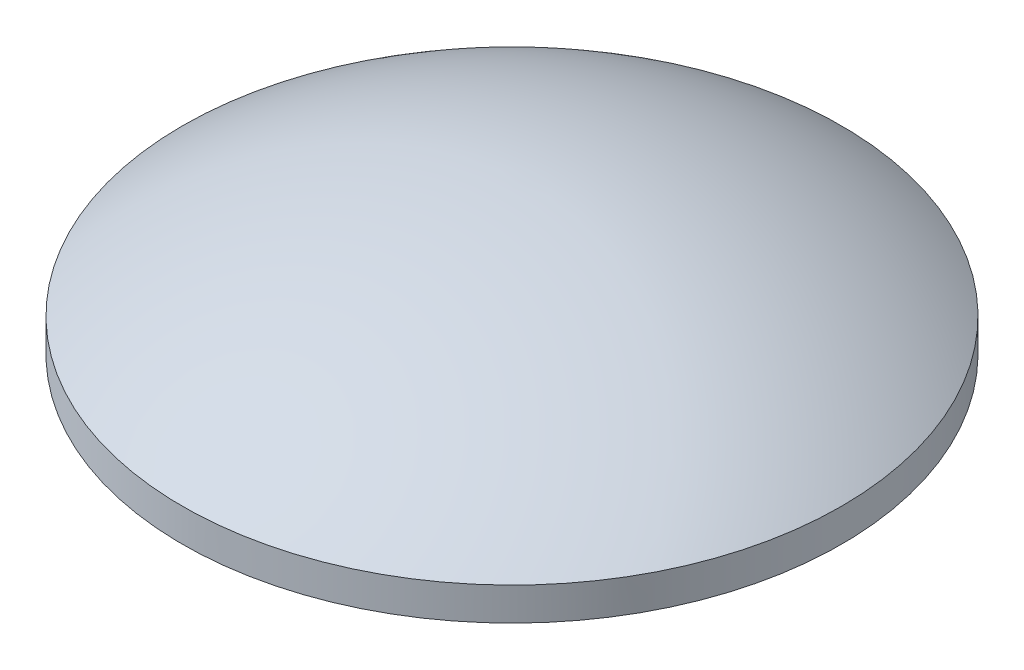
ISO-10303-21;
HEADER;
FILE_DESCRIPTION(('STEP AP214'),'2;1');
FILE_NAME('part.step','',(''),(''),'','','');
FILE_SCHEMA(('AUTOMOTIVE_DESIGN { 1 0 10303 214 1 1 1 1 }'));
ENDSEC;
DATA;
#1=APPLICATION_CONTEXT('core data for automotive mechanical design processes');
#2=APPLICATION_PROTOCOL_DEFINITION('international standard','automotive_design',2000,#1);
#3=PRODUCT_CONTEXT('',#1,'mechanical');
#4=PRODUCT('Part','Part','',(#3));
#5=PRODUCT_RELATED_PRODUCT_CATEGORY('part','',(#4));
#6=PRODUCT_DEFINITION_FORMATION('','',#4);
#7=PRODUCT_DEFINITION_CONTEXT('part definition',#1,'design');
#8=PRODUCT_DEFINITION('design','',#6,#7);
#9=PRODUCT_DEFINITION_SHAPE('','',#8);
#10=(LENGTH_UNIT() NAMED_UNIT(*) SI_UNIT(.MILLI.,.METRE.));
#11=(NAMED_UNIT(*) PLANE_ANGLE_UNIT() SI_UNIT($,.RADIAN.));
#12=(NAMED_UNIT(*) SI_UNIT($,.STERADIAN.) SOLID_ANGLE_UNIT());
#13=UNCERTAINTY_MEASURE_WITH_UNIT(LENGTH_MEASURE(1.E-05),#10,'distance_accuracy_value','');
#14=(GEOMETRIC_REPRESENTATION_CONTEXT(3) GLOBAL_UNCERTAINTY_ASSIGNED_CONTEXT((#13)) GLOBAL_UNIT_ASSIGNED_CONTEXT((#10,
#11,#12)) REPRESENTATION_CONTEXT('',''));
#15=CARTESIAN_POINT('',(0.,0.,0.));
#16=DIRECTION('',(0.,0.,1.));
#17=DIRECTION('',(1.,0.,0.));
#18=AXIS2_PLACEMENT_3D('',#15,#16,#17);
#19=CARTESIAN_POINT('',(-12.,-24.,0.));
#20=DIRECTION('',(0.,1.,0.));
#21=DIRECTION('',(-1.,0.,0.));
#22=AXIS2_PLACEMENT_3D('',#19,#20,#21);
#23=SPHERICAL_SURFACE('',#22,30.);
#24=CARTESIAN_POINT('',(-12.,0.199999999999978,0.));
#25=DIRECTION('',(0.,1.,0.));
#26=DIRECTION('',(-1.,0.,0.));
#27=AXIS2_PLACEMENT_3D('',#24,#25,#26);
#28=CIRCLE('',#27,17.7302002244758);
#29=CARTESIAN_POINT('',(-29.7302002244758,0.199999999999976,0.));
#30=VERTEX_POINT('',#29);
#31=EDGE_CURVE('E10',#30,#30,#28,.T.);
#32=ORIENTED_EDGE('',*,*,#31,.F.);
#33=EDGE_LOOP('',(#32));
#34=FACE_BOUND('',#33,.T.);
#35=ADVANCED_FACE('F35',(#34),#23,.F.);
#36=CARTESIAN_POINT('',(-30.,0.199999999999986,0.));
#37=DIRECTION('',(0.,-1.,0.));
#38=DIRECTION('',(1.,0.,0.));
#39=AXIS2_PLACEMENT_3D('',#36,#37,#38);
#40=PLANE('',#39);
#41=ORIENTED_EDGE('',*,*,#31,.T.);
#42=EDGE_LOOP('',(#41));
#43=FACE_BOUND('',#42,.T.);
#44=CARTESIAN_POINT('',(-12.,0.199999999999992,0.));
#45=DIRECTION('',(0.,1.,0.));
#46=DIRECTION('',(-1.,0.,0.));
#47=AXIS2_PLACEMENT_3D('',#44,#45,#46);
#48=CIRCLE('',#47,18.);
#49=CARTESIAN_POINT('',(-30.,0.19999999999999,0.));
#50=VERTEX_POINT('',#49);
#51=EDGE_CURVE('E41',#50,#50,#48,.T.);
#52=ORIENTED_EDGE('',*,*,#51,.F.);
#53=EDGE_LOOP('',(#52));
#54=FACE_BOUND('',#53,.T.);
#55=ADVANCED_FACE('F56',(#43,#54),#40,.T.);
#56=CARTESIAN_POINT('',(-12.,70.,0.));
#57=DIRECTION('',(0.,1.,0.));
#58=DIRECTION('',(-1.,0.,0.));
#59=AXIS2_PLACEMENT_3D('',#56,#57,#58);
#60=CYLINDRICAL_SURFACE('',#59,18.);
#61=ORIENTED_EDGE('',*,*,#51,.T.);
#62=EDGE_LOOP('',(#61));
#63=FACE_BOUND('',#62,.T.);
#64=CARTESIAN_POINT('',(-12.,2.,0.));
#65=DIRECTION('',(0.,1.,0.));
#66=DIRECTION('',(-1.,0.,0.));
#67=AXIS2_PLACEMENT_3D('',#64,#65,#66);
#68=CIRCLE('',#67,18.);
#69=CARTESIAN_POINT('',(-30.,2.,0.));
#70=VERTEX_POINT('',#69);
#71=EDGE_CURVE('E45',#70,#70,#68,.T.);
#72=ORIENTED_EDGE('',*,*,#71,.F.);
#73=EDGE_LOOP('',(#72));
#74=FACE_BOUND('',#73,.T.);
#75=ADVANCED_FACE('F54',(#63,#74),#60,.T.);
#76=CARTESIAN_POINT('',(-12.,-22.,0.));
#77=DIRECTION('',(0.,1.,0.));
#78=DIRECTION('',(1.,0.,0.));
#79=AXIS2_PLACEMENT_3D('',#76,#77,#78);
#80=SPHERICAL_SURFACE('',#79,30.);
#81=ORIENTED_EDGE('',*,*,#71,.T.);
#82=EDGE_LOOP('',(#81));
#83=FACE_BOUND('',#82,.T.);
#84=ADVANCED_FACE('F52',(#83),#80,.T.);
#85=CLOSED_SHELL('',(#35,#55,#75,#84));
#86=MANIFOLD_SOLID_BREP('B2',#85);
#87=ADVANCED_BREP_SHAPE_REPRESENTATION('',(#18,#86),#14);
#88=SHAPE_DEFINITION_REPRESENTATION(#9,#87);
ENDSEC;
END-ISO-10303-21;
